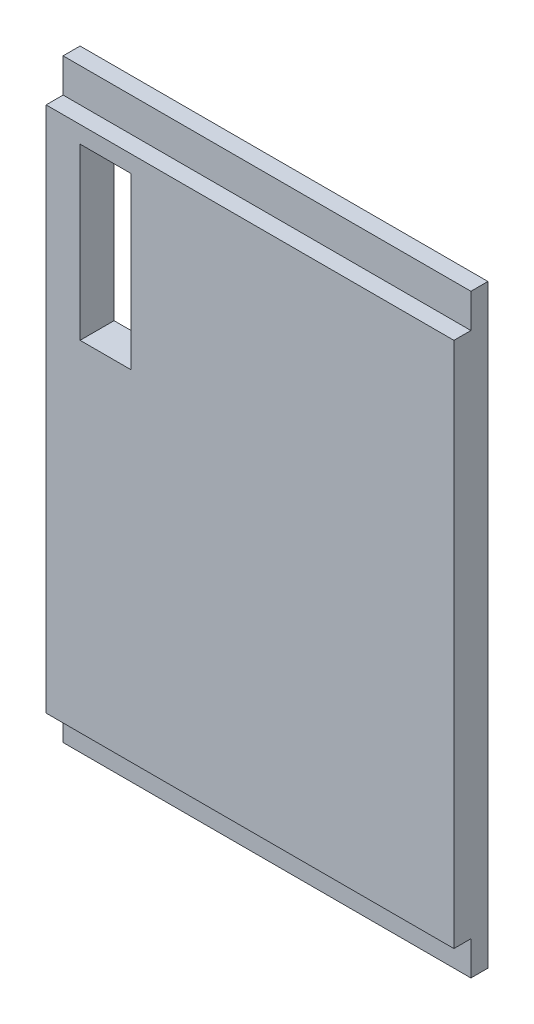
from build123d import *

# Parameters (mm, degrees)
SKETCH_1_W          = 24
SKETCH_1_H          = 35
EXTRUDE_1_DEPTH     = 1
SKETCH_2_W          = 24
SKETCH_2_H          = 31
EXTRUDE_2_DEPTH     = 1
SKETCH_3_W          = 3
SKETCH_3_H          = 10
CUT_EXTRUDE_1_DEPTH = 22.313141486


with BuildPart() as part:
    # Sketch 1 → Extrude 1 (new body)
    with BuildSketch(Plane.XY):
        Rectangle(SKETCH_1_W, SKETCH_1_H)
    extrude(amount=EXTRUDE_1_DEPTH)

    # Sketch 2 → Extrude 2 (add)
    with BuildSketch(Plane.XY.offset(1)):
        Rectangle(SKETCH_2_W, SKETCH_2_H)
    extrude(amount=EXTRUDE_2_DEPTH)

    # Sketch 3 → Cut-Extrude 1 (cut, through all)
    with BuildSketch(Plane(origin=(0, 0, 0), x_dir=(-1, 0, 0), z_dir=(0, 0, -1))):
        with Locations((8.5, 9.5)):
            Rectangle(SKETCH_3_W, SKETCH_3_H)
    extrude(amount=-CUT_EXTRUDE_1_DEPTH, mode=Mode.SUBTRACT)


solid = part.part
